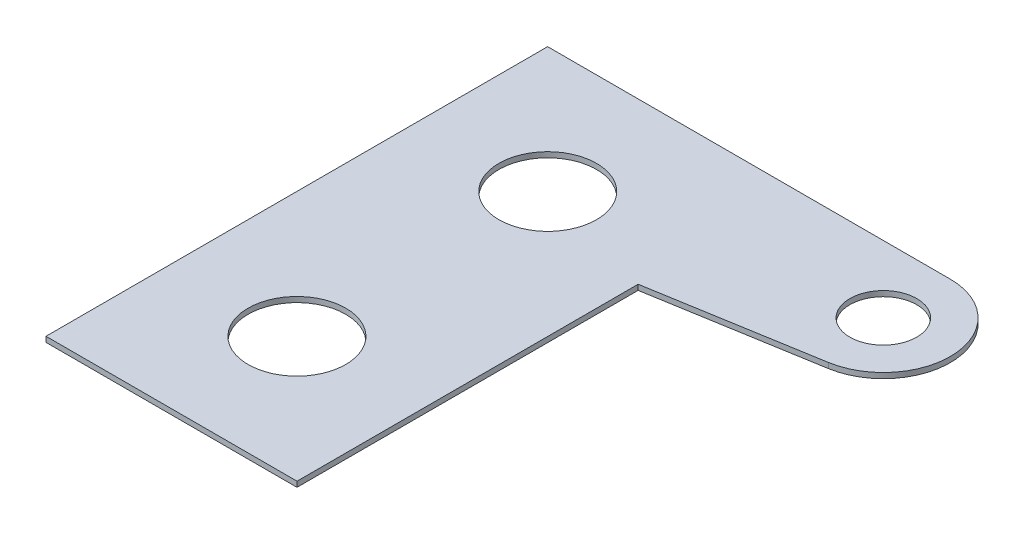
ISO-10303-21;
HEADER;
FILE_DESCRIPTION(('STEP AP214'),'2;1');
FILE_NAME('part.step','',(''),(''),'','','');
FILE_SCHEMA(('AUTOMOTIVE_DESIGN { 1 0 10303 214 1 1 1 1 }'));
ENDSEC;
DATA;
#1=APPLICATION_CONTEXT('core data for automotive mechanical design processes');
#2=APPLICATION_PROTOCOL_DEFINITION('international standard','automotive_design',2000,#1);
#3=PRODUCT_CONTEXT('',#1,'mechanical');
#4=PRODUCT('Part','Part','',(#3));
#5=PRODUCT_RELATED_PRODUCT_CATEGORY('part','',(#4));
#6=PRODUCT_DEFINITION_FORMATION('','',#4);
#7=PRODUCT_DEFINITION_CONTEXT('part definition',#1,'design');
#8=PRODUCT_DEFINITION('design','',#6,#7);
#9=PRODUCT_DEFINITION_SHAPE('','',#8);
#10=(LENGTH_UNIT() NAMED_UNIT(*) SI_UNIT(.MILLI.,.METRE.));
#11=(NAMED_UNIT(*) PLANE_ANGLE_UNIT() SI_UNIT($,.RADIAN.));
#12=(NAMED_UNIT(*) SI_UNIT($,.STERADIAN.) SOLID_ANGLE_UNIT());
#13=UNCERTAINTY_MEASURE_WITH_UNIT(LENGTH_MEASURE(1.E-05),#10,'distance_accuracy_value','');
#14=(GEOMETRIC_REPRESENTATION_CONTEXT(3) GLOBAL_UNCERTAINTY_ASSIGNED_CONTEXT((#13)) GLOBAL_UNIT_ASSIGNED_CONTEXT((#10,
#11,#12)) REPRESENTATION_CONTEXT('',''));
#15=CARTESIAN_POINT('',(0.,0.,0.));
#16=DIRECTION('',(0.,0.,1.));
#17=DIRECTION('',(1.,0.,0.));
#18=AXIS2_PLACEMENT_3D('',#15,#16,#17);
#19=CARTESIAN_POINT('',(4.76631,-0.2032,9.525));
#20=DIRECTION('',(1.,0.,0.));
#21=DIRECTION('',(0.,0.,-1.));
#22=AXIS2_PLACEMENT_3D('',#19,#20,#21);
#23=PLANE('',#22);
#24=DIRECTION('',(0.,0.,-1.));
#25=VECTOR('',#24,1.);
#26=CARTESIAN_POINT('',(4.76631,-0.2032,9.525));
#27=LINE('',#26,#25);
#28=CARTESIAN_POINT('',(4.76631,-0.2032,9.525));
#29=VERTEX_POINT('',#28);
#30=CARTESIAN_POINT('',(4.76631,-0.2032,-3.429));
#31=VERTEX_POINT('',#30);
#32=EDGE_CURVE('E108',#29,#31,#27,.T.);
#33=ORIENTED_EDGE('',*,*,#32,.T.);
#34=DIRECTION('',(0.,1.,0.));
#35=VECTOR('',#34,1.);
#36=CARTESIAN_POINT('',(4.76631,-0.2032,-3.429));
#37=LINE('',#36,#35);
#38=CARTESIAN_POINT('',(4.76631,0.,-3.42899999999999));
#39=VERTEX_POINT('',#38);
#40=EDGE_CURVE('E95',#31,#39,#37,.T.);
#41=ORIENTED_EDGE('',*,*,#40,.T.);
#42=DIRECTION('',(0.,0.,-1.));
#43=VECTOR('',#42,1.);
#44=CARTESIAN_POINT('',(4.76631,0.,9.525));
#45=LINE('',#44,#43);
#46=CARTESIAN_POINT('',(4.76631,0.,9.525));
#47=VERTEX_POINT('',#46);
#48=EDGE_CURVE('E123',#47,#39,#45,.T.);
#49=ORIENTED_EDGE('',*,*,#48,.F.);
#50=DIRECTION('',(0.,1.,0.));
#51=VECTOR('',#50,1.);
#52=CARTESIAN_POINT('',(4.76631,-0.2032,9.525));
#53=LINE('',#52,#51);
#54=EDGE_CURVE('E11',#29,#47,#53,.T.);
#55=ORIENTED_EDGE('',*,*,#54,.F.);
#56=EDGE_LOOP('',(#33,#41,#49,#55));
#57=FACE_BOUND('',#56,.T.);
#58=ADVANCED_FACE('F36',(#57),#23,.T.);
#59=CARTESIAN_POINT('',(-4.76631,-0.2032,9.525));
#60=DIRECTION('',(0.,0.,1.));
#61=DIRECTION('',(1.,0.,0.));
#62=AXIS2_PLACEMENT_3D('',#59,#60,#61);
#63=PLANE('',#62);
#64=DIRECTION('',(1.,0.,0.));
#65=VECTOR('',#64,1.);
#66=CARTESIAN_POINT('',(-4.76631,0.,9.525));
#67=LINE('',#66,#65);
#68=CARTESIAN_POINT('',(-4.76631,0.,9.525));
#69=VERTEX_POINT('',#68);
#70=EDGE_CURVE('E112',#69,#47,#67,.T.);
#71=ORIENTED_EDGE('',*,*,#70,.F.);
#72=DIRECTION('',(0.,1.,0.));
#73=VECTOR('',#72,1.);
#74=CARTESIAN_POINT('',(-4.76631,-0.2032,9.525));
#75=LINE('',#74,#73);
#76=CARTESIAN_POINT('',(-4.76631,-0.2032,9.525));
#77=VERTEX_POINT('',#76);
#78=EDGE_CURVE('E44',#77,#69,#75,.T.);
#79=ORIENTED_EDGE('',*,*,#78,.F.);
#80=DIRECTION('',(1.,0.,0.));
#81=VECTOR('',#80,1.);
#82=CARTESIAN_POINT('',(-4.76631,-0.2032,9.525));
#83=LINE('',#82,#81);
#84=EDGE_CURVE('E133',#77,#29,#83,.T.);
#85=ORIENTED_EDGE('',*,*,#84,.T.);
#86=ORIENTED_EDGE('',*,*,#54,.T.);
#87=EDGE_LOOP('',(#71,#79,#85,#86));
#88=FACE_BOUND('',#87,.T.);
#89=ADVANCED_FACE('F192',(#88),#63,.T.);
#90=CARTESIAN_POINT('',(-4.76631,-0.2032,9.525));
#91=DIRECTION('',(-1.,0.,0.));
#92=DIRECTION('',(0.,0.,1.));
#93=AXIS2_PLACEMENT_3D('',#90,#91,#92);
#94=PLANE('',#93);
#95=DIRECTION('',(0.,0.,1.));
#96=VECTOR('',#95,1.);
#97=CARTESIAN_POINT('',(-4.76631,0.,9.525));
#98=LINE('',#97,#96);
#99=CARTESIAN_POINT('',(-4.76631,0.,-9.525));
#100=VERTEX_POINT('',#99);
#101=EDGE_CURVE('E118',#100,#69,#98,.T.);
#102=ORIENTED_EDGE('',*,*,#101,.F.);
#103=DIRECTION('',(0.,1.,0.));
#104=VECTOR('',#103,1.);
#105=CARTESIAN_POINT('',(-4.76631,-0.2032,-9.525));
#106=LINE('',#105,#104);
#107=CARTESIAN_POINT('',(-4.76631,-0.2032,-9.525));
#108=VERTEX_POINT('',#107);
#109=EDGE_CURVE('E80',#108,#100,#106,.T.);
#110=ORIENTED_EDGE('',*,*,#109,.F.);
#111=DIRECTION('',(0.,0.,1.));
#112=VECTOR('',#111,1.);
#113=CARTESIAN_POINT('',(-4.76631,-0.2032,9.525));
#114=LINE('',#113,#112);
#115=EDGE_CURVE('E115',#108,#77,#114,.T.);
#116=ORIENTED_EDGE('',*,*,#115,.T.);
#117=ORIENTED_EDGE('',*,*,#78,.T.);
#118=EDGE_LOOP('',(#102,#110,#116,#117));
#119=FACE_BOUND('',#118,.T.);
#120=ADVANCED_FACE('F145',(#119),#94,.T.);
#121=CARTESIAN_POINT('',(-4.76631,-0.2032,-9.525));
#122=DIRECTION('',(0.,0.,-1.));
#123=DIRECTION('',(-1.,0.,0.));
#124=AXIS2_PLACEMENT_3D('',#121,#122,#123);
#125=PLANE('',#124);
#126=DIRECTION('',(-1.,0.,0.));
#127=VECTOR('',#126,1.);
#128=CARTESIAN_POINT('',(-4.76631,0.,-9.525));
#129=LINE('',#128,#127);
#130=CARTESIAN_POINT('',(10.5271386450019,0.,-9.525));
#131=VERTEX_POINT('',#130);
#132=EDGE_CURVE('E136',#131,#100,#129,.T.);
#133=ORIENTED_EDGE('',*,*,#132,.F.);
#134=DIRECTION('',(0.,1.,0.));
#135=VECTOR('',#134,1.);
#136=CARTESIAN_POINT('',(10.5271386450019,-0.2032,-9.525));
#137=LINE('',#136,#135);
#138=CARTESIAN_POINT('',(10.5271386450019,-0.2032,-9.525));
#139=VERTEX_POINT('',#138);
#140=EDGE_CURVE('E157',#139,#131,#137,.T.);
#141=ORIENTED_EDGE('',*,*,#140,.F.);
#142=DIRECTION('',(-1.,0.,0.));
#143=VECTOR('',#142,1.);
#144=CARTESIAN_POINT('',(-4.76631,-0.2032,-9.525));
#145=LINE('',#144,#143);
#146=EDGE_CURVE('E111',#139,#108,#145,.T.);
#147=ORIENTED_EDGE('',*,*,#146,.T.);
#148=ORIENTED_EDGE('',*,*,#109,.T.);
#149=EDGE_LOOP('',(#133,#141,#147,#148));
#150=FACE_BOUND('',#149,.T.);
#151=ADVANCED_FACE('F142',(#150),#125,.T.);
#152=CARTESIAN_POINT('',(0.,-0.2032,0.));
#153=DIRECTION('',(0.,-1.,0.));
#154=DIRECTION('',(0.,0.,-1.));
#155=AXIS2_PLACEMENT_3D('',#152,#153,#154);
#156=PLANE('',#155);
#157=CARTESIAN_POINT('',(0.,-0.2032,4.7625));
#158=DIRECTION('',(0.,1.,0.));
#159=DIRECTION('',(0.,0.,-1.));
#160=AXIS2_PLACEMENT_3D('',#157,#158,#159);
#161=CIRCLE('',#160,1.8542);
#162=CARTESIAN_POINT('',(0.,-0.2032,2.9083));
#163=VERTEX_POINT('',#162);
#164=EDGE_CURVE('E163',#163,#163,#161,.T.);
#165=ORIENTED_EDGE('',*,*,#164,.T.);
#166=EDGE_LOOP('',(#165));
#167=FACE_BOUND('',#166,.T.);
#168=CARTESIAN_POINT('',(0.,-0.2032,-4.7625));
#169=DIRECTION('',(0.,1.,0.));
#170=DIRECTION('',(0.,0.,1.));
#171=AXIS2_PLACEMENT_3D('',#168,#169,#170);
#172=CIRCLE('',#171,1.8542);
#173=CARTESIAN_POINT('',(0.,-0.2032,-2.9083));
#174=VERTEX_POINT('',#173);
#175=EDGE_CURVE('E168',#174,#174,#172,.T.);
#176=ORIENTED_EDGE('',*,*,#175,.T.);
#177=EDGE_LOOP('',(#176));
#178=FACE_BOUND('',#177,.T.);
#179=ORIENTED_EDGE('',*,*,#32,.F.);
#180=ORIENTED_EDGE('',*,*,#84,.F.);
#181=ORIENTED_EDGE('',*,*,#115,.F.);
#182=ORIENTED_EDGE('',*,*,#146,.F.);
#183=CARTESIAN_POINT('',(10.5271386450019,-0.2032,-6.98002864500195));
#184=DIRECTION('',(0.,1.,0.));
#185=DIRECTION('',(0.,0.,-1.));
#186=AXIS2_PLACEMENT_3D('',#183,#184,#185);
#187=CIRCLE('',#186,2.54497135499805);
#188=CARTESIAN_POINT('',(10.9498007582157,-0.2032,-4.4704));
#189=VERTEX_POINT('',#188);
#190=EDGE_CURVE('E101',#189,#139,#187,.T.);
#191=ORIENTED_EDGE('',*,*,#190,.F.);
#192=DIRECTION('',(0.986112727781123,0.,-0.166077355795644));
#193=VECTOR('',#192,1.);
#194=CARTESIAN_POINT('',(4.76631,-0.2032,-3.429));
#195=LINE('',#194,#193);
#196=EDGE_CURVE('E98',#31,#189,#195,.T.);
#197=ORIENTED_EDGE('',*,*,#196,.F.);
#198=EDGE_LOOP('',(#179,#180,#181,#182,#191,#197));
#199=FACE_BOUND('',#198,.T.);
#200=CARTESIAN_POINT('',(10.5271386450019,-0.2032,-6.98002864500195));
#201=DIRECTION('',(0.,1.,0.));
#202=DIRECTION('',(0.,0.,1.));
#203=AXIS2_PLACEMENT_3D('',#200,#201,#202);
#204=CIRCLE('',#203,1.27);
#205=CARTESIAN_POINT('',(10.5271386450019,-0.2032,-5.71002864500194));
#206=VERTEX_POINT('',#205);
#207=EDGE_CURVE('E153',#206,#206,#204,.T.);
#208=ORIENTED_EDGE('',*,*,#207,.T.);
#209=EDGE_LOOP('',(#208));
#210=FACE_BOUND('',#209,.T.);
#211=ADVANCED_FACE('F105',(#167,#178,#199,#210),#156,.T.);
#212=CARTESIAN_POINT('',(0.,0.,0.));
#213=DIRECTION('',(0.,-1.,0.));
#214=DIRECTION('',(0.,0.,-1.));
#215=AXIS2_PLACEMENT_3D('',#212,#213,#214);
#216=PLANE('',#215);
#217=CARTESIAN_POINT('',(0.,0.,4.7625));
#218=DIRECTION('',(0.,1.,0.));
#219=DIRECTION('',(0.,0.,-1.));
#220=AXIS2_PLACEMENT_3D('',#217,#218,#219);
#221=CIRCLE('',#220,1.8542);
#222=CARTESIAN_POINT('',(0.,0.,2.9083));
#223=VERTEX_POINT('',#222);
#224=EDGE_CURVE('E159',#223,#223,#221,.T.);
#225=ORIENTED_EDGE('',*,*,#224,.F.);
#226=EDGE_LOOP('',(#225));
#227=FACE_BOUND('',#226,.T.);
#228=CARTESIAN_POINT('',(0.,0.,-4.7625));
#229=DIRECTION('',(0.,1.,0.));
#230=DIRECTION('',(0.,0.,1.));
#231=AXIS2_PLACEMENT_3D('',#228,#229,#230);
#232=CIRCLE('',#231,1.8542);
#233=CARTESIAN_POINT('',(0.,0.,-2.9083));
#234=VERTEX_POINT('',#233);
#235=EDGE_CURVE('E129',#234,#234,#232,.T.);
#236=ORIENTED_EDGE('',*,*,#235,.F.);
#237=EDGE_LOOP('',(#236));
#238=FACE_BOUND('',#237,.T.);
#239=ORIENTED_EDGE('',*,*,#48,.T.);
#240=DIRECTION('',(0.986112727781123,0.,-0.166077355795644));
#241=VECTOR('',#240,1.);
#242=CARTESIAN_POINT('',(4.76631,0.,-3.429));
#243=LINE('',#242,#241);
#244=CARTESIAN_POINT('',(10.9498007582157,0.,-4.4704));
#245=VERTEX_POINT('',#244);
#246=EDGE_CURVE('E52',#39,#245,#243,.T.);
#247=ORIENTED_EDGE('',*,*,#246,.T.);
#248=CARTESIAN_POINT('',(10.5271386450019,0.,-6.98002864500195));
#249=DIRECTION('',(0.,1.,0.));
#250=DIRECTION('',(0.,0.,-1.));
#251=AXIS2_PLACEMENT_3D('',#248,#249,#250);
#252=CIRCLE('',#251,2.54497135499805);
#253=EDGE_CURVE('E110',#245,#131,#252,.T.);
#254=ORIENTED_EDGE('',*,*,#253,.T.);
#255=ORIENTED_EDGE('',*,*,#132,.T.);
#256=ORIENTED_EDGE('',*,*,#101,.T.);
#257=ORIENTED_EDGE('',*,*,#70,.T.);
#258=EDGE_LOOP('',(#239,#247,#254,#255,#256,#257));
#259=FACE_BOUND('',#258,.T.);
#260=CARTESIAN_POINT('',(10.5271386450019,0.,-6.98002864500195));
#261=DIRECTION('',(0.,1.,0.));
#262=DIRECTION('',(0.,0.,1.));
#263=AXIS2_PLACEMENT_3D('',#260,#261,#262);
#264=CIRCLE('',#263,1.27);
#265=CARTESIAN_POINT('',(10.5271386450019,0.,-5.71002864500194));
#266=VERTEX_POINT('',#265);
#267=EDGE_CURVE('E305',#266,#266,#264,.T.);
#268=ORIENTED_EDGE('',*,*,#267,.F.);
#269=EDGE_LOOP('',(#268));
#270=FACE_BOUND('',#269,.T.);
#271=ADVANCED_FACE('F148',(#227,#238,#259,#270),#216,.F.);
#272=CARTESIAN_POINT('',(0.,-0.2032,-4.7625));
#273=DIRECTION('',(0.,1.,0.));
#274=DIRECTION('',(0.,0.,1.));
#275=AXIS2_PLACEMENT_3D('',#272,#273,#274);
#276=CYLINDRICAL_SURFACE('',#275,1.8542);
#277=ORIENTED_EDGE('',*,*,#175,.F.);
#278=EDGE_LOOP('',(#277));
#279=FACE_BOUND('',#278,.T.);
#280=ORIENTED_EDGE('',*,*,#235,.T.);
#281=EDGE_LOOP('',(#280));
#282=FACE_BOUND('',#281,.T.);
#283=ADVANCED_FACE('F175',(#279,#282),#276,.F.);
#284=CARTESIAN_POINT('',(0.,-0.2032,4.7625));
#285=DIRECTION('',(0.,1.,0.));
#286=DIRECTION('',(0.,0.,1.));
#287=AXIS2_PLACEMENT_3D('',#284,#285,#286);
#288=CYLINDRICAL_SURFACE('',#287,1.8542);
#289=ORIENTED_EDGE('',*,*,#164,.F.);
#290=EDGE_LOOP('',(#289));
#291=FACE_BOUND('',#290,.T.);
#292=ORIENTED_EDGE('',*,*,#224,.T.);
#293=EDGE_LOOP('',(#292));
#294=FACE_BOUND('',#293,.T.);
#295=ADVANCED_FACE('F184',(#291,#294),#288,.F.);
#296=CARTESIAN_POINT('',(10.5271386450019,-0.2032,-6.98002864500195));
#297=DIRECTION('',(0.,1.,0.));
#298=DIRECTION('',(0.,0.,1.));
#299=AXIS2_PLACEMENT_3D('',#296,#297,#298);
#300=CYLINDRICAL_SURFACE('',#299,2.54497135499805);
#301=ORIENTED_EDGE('',*,*,#253,.F.);
#302=DIRECTION('',(0.,1.,0.));
#303=VECTOR('',#302,1.);
#304=CARTESIAN_POINT('',(10.9498007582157,-0.2032,-4.4704));
#305=LINE('',#304,#303);
#306=EDGE_CURVE('E100',#189,#245,#305,.T.);
#307=ORIENTED_EDGE('',*,*,#306,.F.);
#308=ORIENTED_EDGE('',*,*,#190,.T.);
#309=ORIENTED_EDGE('',*,*,#140,.T.);
#310=EDGE_LOOP('',(#301,#307,#308,#309));
#311=FACE_BOUND('',#310,.T.);
#312=ADVANCED_FACE('F221',(#311),#300,.T.);
#313=CARTESIAN_POINT('',(4.76631,-0.2032,-3.429));
#314=DIRECTION('',(0.166077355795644,0.,0.986112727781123));
#315=DIRECTION('',(0.986112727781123,0.,-0.166077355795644));
#316=AXIS2_PLACEMENT_3D('',#313,#314,#315);
#317=PLANE('',#316);
#318=ORIENTED_EDGE('',*,*,#246,.F.);
#319=ORIENTED_EDGE('',*,*,#40,.F.);
#320=ORIENTED_EDGE('',*,*,#196,.T.);
#321=ORIENTED_EDGE('',*,*,#306,.T.);
#322=EDGE_LOOP('',(#318,#319,#320,#321));
#323=FACE_BOUND('',#322,.T.);
#324=ADVANCED_FACE('F97',(#323),#317,.T.);
#325=CARTESIAN_POINT('',(10.5271386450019,-0.2032,-6.98002864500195));
#326=DIRECTION('',(0.,1.,0.));
#327=DIRECTION('',(0.,0.,1.));
#328=AXIS2_PLACEMENT_3D('',#325,#326,#327);
#329=CYLINDRICAL_SURFACE('',#328,1.27);
#330=ORIENTED_EDGE('',*,*,#207,.F.);
#331=EDGE_LOOP('',(#330));
#332=FACE_BOUND('',#331,.T.);
#333=ORIENTED_EDGE('',*,*,#267,.T.);
#334=EDGE_LOOP('',(#333));
#335=FACE_BOUND('',#334,.T.);
#336=ADVANCED_FACE('F234',(#332,#335),#329,.F.);
#337=CLOSED_SHELL('',(#58,#89,#120,#151,#211,#271,#283,#295,#312,#324,#336));
#338=MANIFOLD_SOLID_BREP('B2',#337);
#339=ADVANCED_BREP_SHAPE_REPRESENTATION('',(#18,#338),#14);
#340=SHAPE_DEFINITION_REPRESENTATION(#9,#339);
ENDSEC;
END-ISO-10303-21;
